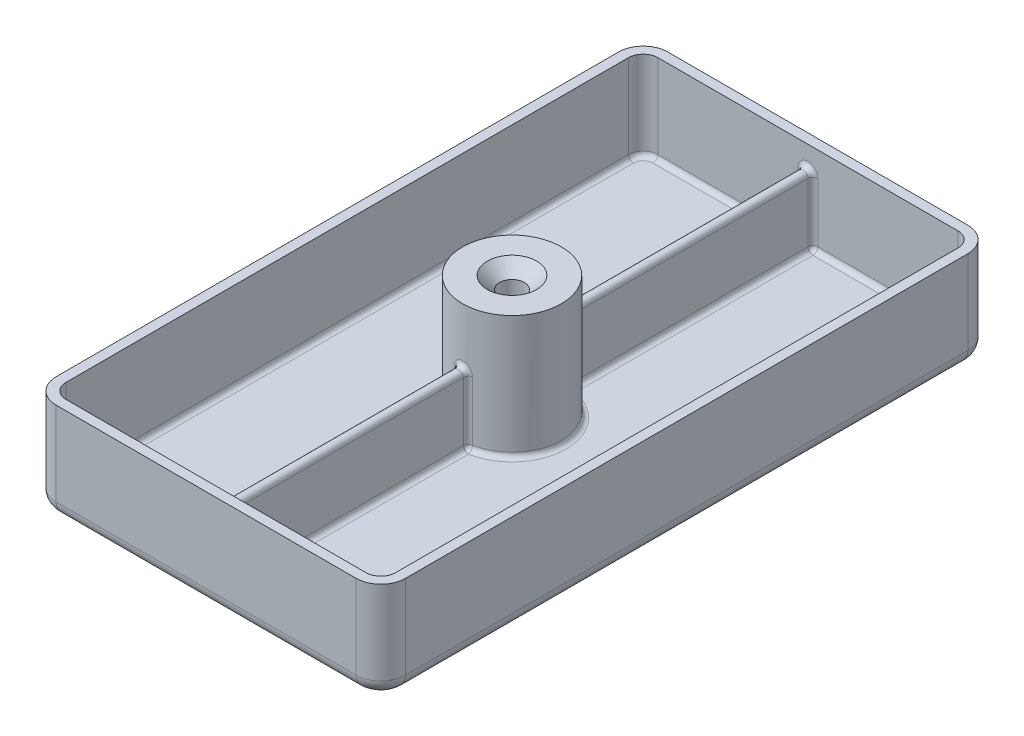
from build123d import *

# Parameters (mm, degrees)
BASE_EXTRUDE_DEPTH     = 20
FILLET1_R              = 5
FILLET2_R              = 3
SHELL1_T               = -2
RIB1_REACH             = 75.175
SKETCH6_WALLS_W        = 2
SKETCH6_WALLS_H        = 216.25372280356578
FILLET5_RADIUS         = 1
FILLET5_LENGTH         = 120.01036485
SKETCH3_R              = 10
CYLBOSS_DEPTH          = 25
FILLET4_R              = 1
COUNTERSNK_D           = 5
COUNTERSNK_CSINK_D     = 10
COUNTERSNK_CSINK_ANGLE = 90


with BuildPart() as part:
    # Sketch1 → Base-Extrude (new body)
    with BuildSketch(Plane(origin=(0, 0, 0), x_dir=(1, 0, 0), z_dir=(0, 1, 0))):
        Polygon((-35.41024463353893, -62.00518242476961), (35.410244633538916, -62.00518242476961), (35.41024463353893, 62.00518242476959), (-35.41024463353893, 62.00518242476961), align=None)
    extrude(amount=BASE_EXTRUDE_DEPTH)

    # Fillet1
    fillet1_edges = [part.edges().sort_by_distance(p)[0] for p in [
        (-35.41024463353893, 10, 62.00518242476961),
        (35.410244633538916, 10, 62.00518242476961),
        (35.41024463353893, 10, -62.00518242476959),
        (-35.41024463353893, 10, -62.00518242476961),
    ]]
    fillet(fillet1_edges, radius=FILLET1_R)

    # Fillet2
    fillet2_edges = [part.edges().sort_by_distance(p)[0] for p in [
        (-35.41024463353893, 0, 0),
        (0, 0, -62.0051824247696),
        (35.41024463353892, 0, 7.11e-15),
        (-7.11e-15, 0, 62.00518242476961),
        (33.94577853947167, 0, -60.54071633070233),
        (33.945778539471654, 0, 60.540716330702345),
        (-33.94577853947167, 0, 60.540716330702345),
        (-33.94577853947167, 0, -60.540716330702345),
    ]]
    fillet(fillet2_edges, radius=FILLET2_R)

    # Shell1
    shell1_openings = [part.faces().sort_by_distance(p)[0] for p in [
        (0, 20, 0),
    ]]
    offset(amount=SHELL1_T, openings=shell1_openings, kind=Kind.INTERSECTION)

    # Sketch6 walls → Rib1 (add, up to next)
    with BuildSketch(Plane(origin=(0, 16, 0), x_dir=(-1, 0, 0), z_dir=(0, 1, 0)), mode=Mode.PRIVATE) as rib1_sk1:
        with Locations((0, -0.4188286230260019)):
            Rectangle(SKETCH6_WALLS_W, SKETCH6_WALLS_H)
    rib1_tool1 = extrude(rib1_sk1.sketch, amount=-RIB1_REACH, mode=Mode.PRIVATE) - part.part
    add(rib1_tool1.solids().sort_by_distance((0, 16, -0.418828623))[0])

    # Fillet5: full round fillet: the end face becomes a half cylinder, R = half its width
    fillet5_face = Plane((0, 16, 0), x_dir=(0, 0, 1), z_dir=(0, 1, 0))  # on the end face: x along it, z out of the body
    fillet5_slab = fillet5_face.offset(-FILLET5_RADIUS / 2) * Box(FILLET5_LENGTH, 2 * FILLET5_RADIUS, FILLET5_RADIUS, mode=Mode.PRIVATE)  # the body's end, R deep
    fillet5_round = Plane((0, 15, 0), x_dir=(0, 1, 0), z_dir=(0, 0, 1)) * Cylinder(FILLET5_RADIUS, FILLET5_LENGTH, mode=Mode.PRIVATE)  # its axis R under the face
    add(fillet5_slab - fillet5_round, mode=Mode.SUBTRACT)

    # Sketch3 → CylBoss (add)
    with BuildSketch(Plane(origin=(0, 2, 0), x_dir=(-1, 0, 0), z_dir=(0, 1, 0))):
        with Locations(Location((0, 0, 0), (0, 0, 275.739170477))):
            Circle(SKETCH3_R)
    extrude(amount=CYLBOSS_DEPTH)

    # Fillet4
    fillet4_edges = [part.edges().sort_by_distance(p)[0] for p in [
        (1, 9, 60.00518242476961),
        (1, 9, -60.00518242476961),
        (-1, 9, 60.005182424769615),
        (-1, 9, -60.0051824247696),
        (-6e-17, 16, -60.005182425),
        (6e-17, 16, 60.005182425),
        (1, 2, -34.47752839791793),
        (1, 8.5, 9.9498743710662),
        (1, 8.5, -9.9498743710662),
        (-1, 2, -34.47752839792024),
        (-0.9999999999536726, 8.5, -9.949874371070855),
        (4.81118827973e-06, 15.999999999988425, -9.999999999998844),
        (-1, 8.5, 9.9498743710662),
        (-1, 8.5, 9.9498743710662),
        (-10, 2, -2.318834e-11),
        (10, 2, -1.8274e-13),
        (1, 2.292893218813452, 59.712289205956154),
        (-1, 2.292893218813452, 59.712289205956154),
        (1.0000000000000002, 2.292893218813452, -59.712289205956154),
        (-0.9999999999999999, 2.292893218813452, -59.712289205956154),
        (1, 2, 34.4775283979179),
        (-1, 2, 34.47752839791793),
    ]]
    fillet(fillet4_edges, radius=FILLET4_R)

    # CounterSnk (through all)
    with Locations(Plane(origin=(0, 27.000000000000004, 0), x_dir=(-1, 0, 0), z_dir=(0, 1, 0))):
        with Locations((0, 0)):
            CounterSinkHole(COUNTERSNK_D / 2, COUNTERSNK_CSINK_D / 2, counter_sink_angle=COUNTERSNK_CSINK_ANGLE)


solid = part.part
